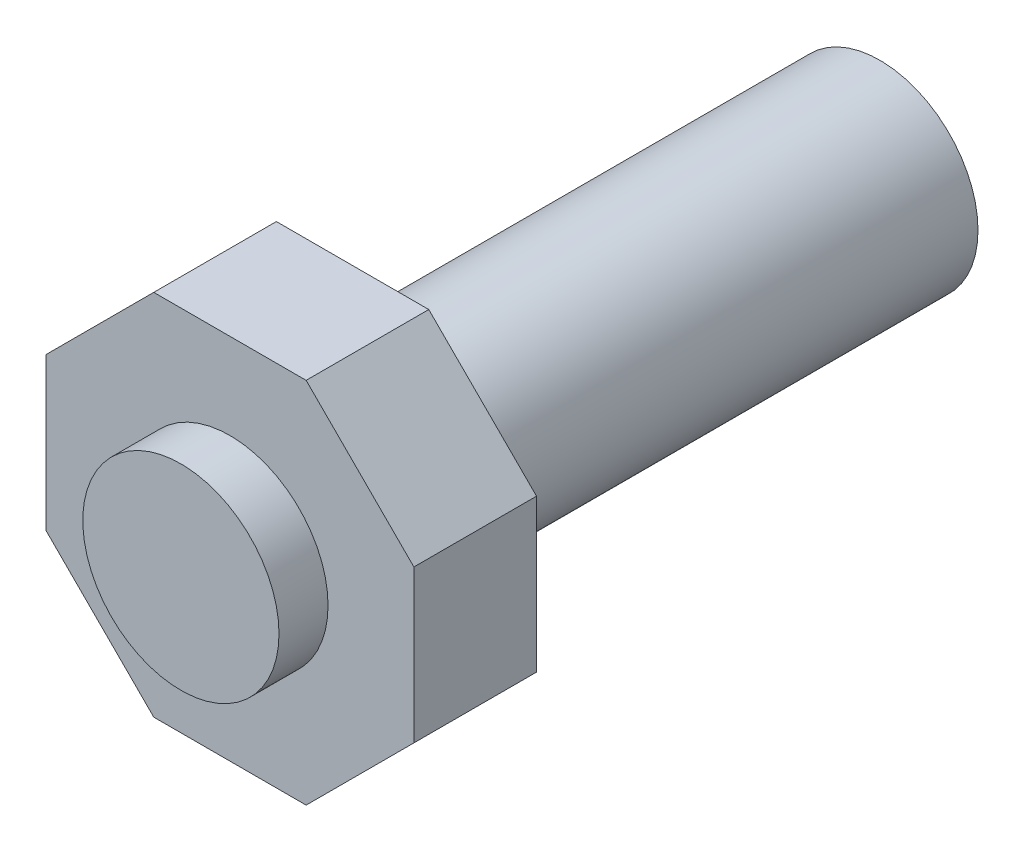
ISO-10303-21;
HEADER;
FILE_DESCRIPTION(('STEP AP214'),'2;1');
FILE_NAME('part.step','',(''),(''),'','','');
FILE_SCHEMA(('AUTOMOTIVE_DESIGN { 1 0 10303 214 1 1 1 1 }'));
ENDSEC;
DATA;
#1=APPLICATION_CONTEXT('core data for automotive mechanical design processes');
#2=APPLICATION_PROTOCOL_DEFINITION('international standard','automotive_design',2000,#1);
#3=PRODUCT_CONTEXT('',#1,'mechanical');
#4=PRODUCT('Part','Part','',(#3));
#5=PRODUCT_RELATED_PRODUCT_CATEGORY('part','',(#4));
#6=PRODUCT_DEFINITION_FORMATION('','',#4);
#7=PRODUCT_DEFINITION_CONTEXT('part definition',#1,'design');
#8=PRODUCT_DEFINITION('design','',#6,#7);
#9=PRODUCT_DEFINITION_SHAPE('','',#8);
#10=(LENGTH_UNIT() NAMED_UNIT(*) SI_UNIT(.MILLI.,.METRE.));
#11=(NAMED_UNIT(*) PLANE_ANGLE_UNIT() SI_UNIT($,.RADIAN.));
#12=(NAMED_UNIT(*) SI_UNIT($,.STERADIAN.) SOLID_ANGLE_UNIT());
#13=UNCERTAINTY_MEASURE_WITH_UNIT(LENGTH_MEASURE(1.E-05),#10,'distance_accuracy_value','');
#14=(GEOMETRIC_REPRESENTATION_CONTEXT(3) GLOBAL_UNCERTAINTY_ASSIGNED_CONTEXT((#13)) GLOBAL_UNIT_ASSIGNED_CONTEXT((#10,
#11,#12)) REPRESENTATION_CONTEXT('',''));
#15=CARTESIAN_POINT('',(0.,0.,0.));
#16=DIRECTION('',(0.,0.,1.));
#17=DIRECTION('',(1.,0.,0.));
#18=AXIS2_PLACEMENT_3D('',#15,#16,#17);
#19=CARTESIAN_POINT('',(8.,0.,43.));
#20=DIRECTION('',(0.,0.,1.));
#21=DIRECTION('',(1.,0.,0.));
#22=AXIS2_PLACEMENT_3D('',#19,#20,#21);
#23=PLANE('',#22);
#24=CARTESIAN_POINT('',(0.,0.,43.));
#25=DIRECTION('',(0.,0.,1.));
#26=DIRECTION('',(1.,0.,0.));
#27=AXIS2_PLACEMENT_3D('',#24,#25,#26);
#28=CIRCLE('',#27,8.);
#29=CARTESIAN_POINT('',(8.,0.,43.));
#30=VERTEX_POINT('',#29);
#31=EDGE_CURVE('E22',#30,#30,#28,.T.);
#32=ORIENTED_EDGE('',*,*,#31,.T.);
#33=EDGE_LOOP('',(#32));
#34=FACE_BOUND('',#33,.T.);
#35=DIRECTION('',(-0.707106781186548,-0.707106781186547,0.));
#36=VECTOR('',#35,1.);
#37=CARTESIAN_POINT('',(15.,-6.21320343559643,43.));
#38=LINE('',#37,#36);
#39=CARTESIAN_POINT('',(15.,-6.21320343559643,43.));
#40=VERTEX_POINT('',#39);
#41=CARTESIAN_POINT('',(6.21320343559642,-15.,43.));
#42=VERTEX_POINT('',#41);
#43=EDGE_CURVE('E91',#40,#42,#38,.T.);
#44=ORIENTED_EDGE('',*,*,#43,.T.);
#45=DIRECTION('',(1.,0.,0.));
#46=VECTOR('',#45,1.);
#47=CARTESIAN_POINT('',(-6.21320343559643,-15.,43.));
#48=LINE('',#47,#46);
#49=CARTESIAN_POINT('',(-6.21320343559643,-15.,43.));
#50=VERTEX_POINT('',#49);
#51=EDGE_CURVE('E97',#50,#42,#48,.T.);
#52=ORIENTED_EDGE('',*,*,#51,.F.);
#53=DIRECTION('',(0.707106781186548,-0.707106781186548,0.));
#54=VECTOR('',#53,1.);
#55=CARTESIAN_POINT('',(-15.,-6.21320343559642,43.));
#56=LINE('',#55,#54);
#57=CARTESIAN_POINT('',(-15.,-6.21320343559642,43.));
#58=VERTEX_POINT('',#57);
#59=EDGE_CURVE('E29',#58,#50,#56,.T.);
#60=ORIENTED_EDGE('',*,*,#59,.F.);
#61=DIRECTION('',(0.,-1.,0.));
#62=VECTOR('',#61,1.);
#63=CARTESIAN_POINT('',(-15.,6.21320343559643,43.));
#64=LINE('',#63,#62);
#65=CARTESIAN_POINT('',(-15.,6.21320343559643,43.));
#66=VERTEX_POINT('',#65);
#67=EDGE_CURVE('E111',#66,#58,#64,.T.);
#68=ORIENTED_EDGE('',*,*,#67,.F.);
#69=DIRECTION('',(0.707106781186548,0.707106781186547,0.));
#70=VECTOR('',#69,1.);
#71=CARTESIAN_POINT('',(-15.,6.21320343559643,43.));
#72=LINE('',#71,#70);
#73=CARTESIAN_POINT('',(-6.21320343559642,15.,43.));
#74=VERTEX_POINT('',#73);
#75=EDGE_CURVE('E108',#66,#74,#72,.T.);
#76=ORIENTED_EDGE('',*,*,#75,.T.);
#77=DIRECTION('',(1.,0.,0.));
#78=VECTOR('',#77,1.);
#79=CARTESIAN_POINT('',(-6.21320343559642,15.,43.));
#80=LINE('',#79,#78);
#81=CARTESIAN_POINT('',(6.21320343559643,15.,43.));
#82=VERTEX_POINT('',#81);
#83=EDGE_CURVE('E103',#74,#82,#80,.T.);
#84=ORIENTED_EDGE('',*,*,#83,.T.);
#85=DIRECTION('',(0.707106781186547,-0.707106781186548,0.));
#86=VECTOR('',#85,1.);
#87=CARTESIAN_POINT('',(6.21320343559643,15.,43.));
#88=LINE('',#87,#86);
#89=CARTESIAN_POINT('',(15.,6.21320343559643,43.));
#90=VERTEX_POINT('',#89);
#91=EDGE_CURVE('E101',#82,#90,#88,.T.);
#92=ORIENTED_EDGE('',*,*,#91,.T.);
#93=DIRECTION('',(0.,-1.,0.));
#94=VECTOR('',#93,1.);
#95=CARTESIAN_POINT('',(15.,6.21320343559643,43.));
#96=LINE('',#95,#94);
#97=EDGE_CURVE('E83',#90,#40,#96,.T.);
#98=ORIENTED_EDGE('',*,*,#97,.T.);
#99=EDGE_LOOP('',(#44,#52,#60,#68,#76,#84,#92,#98));
#100=FACE_BOUND('',#99,.T.);
#101=ADVANCED_FACE('F14',(#34,#100),#23,.F.);
#102=CARTESIAN_POINT('',(0.,0.,0.));
#103=DIRECTION('',(0.,0.,1.));
#104=DIRECTION('',(1.,0.,0.));
#105=AXIS2_PLACEMENT_3D('',#102,#103,#104);
#106=PLANE('',#105);
#107=CARTESIAN_POINT('',(0.,0.,0.));
#108=DIRECTION('',(0.,0.,1.));
#109=DIRECTION('',(1.,0.,0.));
#110=AXIS2_PLACEMENT_3D('',#107,#108,#109);
#111=CIRCLE('',#110,8.);
#112=CARTESIAN_POINT('',(8.,0.,0.));
#113=VERTEX_POINT('',#112);
#114=EDGE_CURVE('E9',#113,#113,#111,.T.);
#115=ORIENTED_EDGE('',*,*,#114,.F.);
#116=EDGE_LOOP('',(#115));
#117=FACE_BOUND('',#116,.T.);
#118=ADVANCED_FACE('F16',(#117),#106,.F.);
#119=CARTESIAN_POINT('',(0.,0.,80.));
#120=DIRECTION('',(0.,0.,1.));
#121=DIRECTION('',(1.,0.,0.));
#122=AXIS2_PLACEMENT_3D('',#119,#120,#121);
#123=CYLINDRICAL_SURFACE('',#122,8.);
#124=ORIENTED_EDGE('',*,*,#31,.F.);
#125=EDGE_LOOP('',(#124));
#126=FACE_BOUND('',#125,.T.);
#127=ORIENTED_EDGE('',*,*,#114,.T.);
#128=EDGE_LOOP('',(#127));
#129=FACE_BOUND('',#128,.T.);
#130=ADVANCED_FACE('F155',(#126,#129),#123,.T.);
#131=CARTESIAN_POINT('',(15.,-6.21320343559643,53.));
#132=DIRECTION('',(0.707106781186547,-0.707106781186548,0.));
#133=DIRECTION('',(0.707106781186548,0.707106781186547,0.));
#134=AXIS2_PLACEMENT_3D('',#131,#132,#133);
#135=PLANE('',#134);
#136=DIRECTION('',(0.,0.,-1.));
#137=VECTOR('',#136,1.);
#138=CARTESIAN_POINT('',(15.,-6.21320343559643,53.));
#139=LINE('',#138,#137);
#140=CARTESIAN_POINT('',(15.,-6.21320343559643,53.));
#141=VERTEX_POINT('',#140);
#142=EDGE_CURVE('E79',#141,#40,#139,.T.);
#143=ORIENTED_EDGE('',*,*,#142,.F.);
#144=DIRECTION('',(-0.707106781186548,-0.707106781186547,0.));
#145=VECTOR('',#144,1.);
#146=CARTESIAN_POINT('',(15.,-6.21320343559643,53.));
#147=LINE('',#146,#145);
#148=CARTESIAN_POINT('',(6.21320343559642,-15.,53.));
#149=VERTEX_POINT('',#148);
#150=EDGE_CURVE('E37',#141,#149,#147,.T.);
#151=ORIENTED_EDGE('',*,*,#150,.T.);
#152=DIRECTION('',(0.,0.,-1.));
#153=VECTOR('',#152,1.);
#154=CARTESIAN_POINT('',(6.21320343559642,-15.,53.));
#155=LINE('',#154,#153);
#156=EDGE_CURVE('E93',#149,#42,#155,.T.);
#157=ORIENTED_EDGE('',*,*,#156,.T.);
#158=ORIENTED_EDGE('',*,*,#43,.F.);
#159=EDGE_LOOP('',(#143,#151,#157,#158));
#160=FACE_BOUND('',#159,.T.);
#161=ADVANCED_FACE('F92',(#160),#135,.T.);
#162=CARTESIAN_POINT('',(15.,6.21320343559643,53.));
#163=DIRECTION('',(1.,0.,0.));
#164=DIRECTION('',(0.,0.,-1.));
#165=AXIS2_PLACEMENT_3D('',#162,#163,#164);
#166=PLANE('',#165);
#167=DIRECTION('',(0.,0.,-1.));
#168=VECTOR('',#167,1.);
#169=CARTESIAN_POINT('',(15.,6.21320343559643,53.));
#170=LINE('',#169,#168);
#171=CARTESIAN_POINT('',(15.,6.21320343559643,53.));
#172=VERTEX_POINT('',#171);
#173=EDGE_CURVE('E88',#172,#90,#170,.T.);
#174=ORIENTED_EDGE('',*,*,#173,.F.);
#175=DIRECTION('',(0.,-1.,0.));
#176=VECTOR('',#175,1.);
#177=CARTESIAN_POINT('',(15.,6.21320343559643,53.));
#178=LINE('',#177,#176);
#179=EDGE_CURVE('E86',#172,#141,#178,.T.);
#180=ORIENTED_EDGE('',*,*,#179,.T.);
#181=ORIENTED_EDGE('',*,*,#142,.T.);
#182=ORIENTED_EDGE('',*,*,#97,.F.);
#183=EDGE_LOOP('',(#174,#180,#181,#182));
#184=FACE_BOUND('',#183,.T.);
#185=ADVANCED_FACE('F81',(#184),#166,.T.);
#186=CARTESIAN_POINT('',(6.21320343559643,15.,53.));
#187=DIRECTION('',(0.707106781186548,0.707106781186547,0.));
#188=DIRECTION('',(-0.707106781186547,0.707106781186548,0.));
#189=AXIS2_PLACEMENT_3D('',#186,#187,#188);
#190=PLANE('',#189);
#191=DIRECTION('',(0.,0.,-1.));
#192=VECTOR('',#191,1.);
#193=CARTESIAN_POINT('',(6.21320343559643,15.,53.));
#194=LINE('',#193,#192);
#195=CARTESIAN_POINT('',(6.21320343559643,15.,53.));
#196=VERTEX_POINT('',#195);
#197=EDGE_CURVE('E144',#196,#82,#194,.T.);
#198=ORIENTED_EDGE('',*,*,#197,.F.);
#199=DIRECTION('',(0.707106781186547,-0.707106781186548,0.));
#200=VECTOR('',#199,1.);
#201=CARTESIAN_POINT('',(6.21320343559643,15.,53.));
#202=LINE('',#201,#200);
#203=EDGE_CURVE('E124',#196,#172,#202,.T.);
#204=ORIENTED_EDGE('',*,*,#203,.T.);
#205=ORIENTED_EDGE('',*,*,#173,.T.);
#206=ORIENTED_EDGE('',*,*,#91,.F.);
#207=EDGE_LOOP('',(#198,#204,#205,#206));
#208=FACE_BOUND('',#207,.T.);
#209=ADVANCED_FACE('F186',(#208),#190,.T.);
#210=CARTESIAN_POINT('',(-6.21320343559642,15.,53.));
#211=DIRECTION('',(0.,1.,0.));
#212=DIRECTION('',(-1.,0.,0.));
#213=AXIS2_PLACEMENT_3D('',#210,#211,#212);
#214=PLANE('',#213);
#215=DIRECTION('',(0.,0.,-1.));
#216=VECTOR('',#215,1.);
#217=CARTESIAN_POINT('',(-6.21320343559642,15.,53.));
#218=LINE('',#217,#216);
#219=CARTESIAN_POINT('',(-6.21320343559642,15.,53.));
#220=VERTEX_POINT('',#219);
#221=EDGE_CURVE('E142',#220,#74,#218,.T.);
#222=ORIENTED_EDGE('',*,*,#221,.F.);
#223=DIRECTION('',(1.,0.,0.));
#224=VECTOR('',#223,1.);
#225=CARTESIAN_POINT('',(-6.21320343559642,15.,53.));
#226=LINE('',#225,#224);
#227=EDGE_CURVE('E128',#220,#196,#226,.T.);
#228=ORIENTED_EDGE('',*,*,#227,.T.);
#229=ORIENTED_EDGE('',*,*,#197,.T.);
#230=ORIENTED_EDGE('',*,*,#83,.F.);
#231=EDGE_LOOP('',(#222,#228,#229,#230));
#232=FACE_BOUND('',#231,.T.);
#233=ADVANCED_FACE('F189',(#232),#214,.T.);
#234=CARTESIAN_POINT('',(-15.,6.21320343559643,53.));
#235=DIRECTION('',(-0.707106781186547,0.707106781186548,0.));
#236=DIRECTION('',(-0.707106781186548,-0.707106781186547,0.));
#237=AXIS2_PLACEMENT_3D('',#234,#235,#236);
#238=PLANE('',#237);
#239=DIRECTION('',(0.,0.,-1.));
#240=VECTOR('',#239,1.);
#241=CARTESIAN_POINT('',(-15.,6.21320343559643,53.));
#242=LINE('',#241,#240);
#243=CARTESIAN_POINT('',(-15.,6.21320343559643,53.));
#244=VERTEX_POINT('',#243);
#245=EDGE_CURVE('E140',#244,#66,#242,.T.);
#246=ORIENTED_EDGE('',*,*,#245,.F.);
#247=DIRECTION('',(0.707106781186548,0.707106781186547,0.));
#248=VECTOR('',#247,1.);
#249=CARTESIAN_POINT('',(-15.,6.21320343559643,53.));
#250=LINE('',#249,#248);
#251=EDGE_CURVE('E125',#244,#220,#250,.T.);
#252=ORIENTED_EDGE('',*,*,#251,.T.);
#253=ORIENTED_EDGE('',*,*,#221,.T.);
#254=ORIENTED_EDGE('',*,*,#75,.F.);
#255=EDGE_LOOP('',(#246,#252,#253,#254));
#256=FACE_BOUND('',#255,.T.);
#257=ADVANCED_FACE('F193',(#256),#238,.T.);
#258=CARTESIAN_POINT('',(-15.,6.21320343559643,53.));
#259=DIRECTION('',(1.,0.,0.));
#260=DIRECTION('',(0.,1.,0.));
#261=AXIS2_PLACEMENT_3D('',#258,#259,#260);
#262=PLANE('',#261);
#263=DIRECTION('',(0.,0.,-1.));
#264=VECTOR('',#263,1.);
#265=CARTESIAN_POINT('',(-15.,-6.21320343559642,53.));
#266=LINE('',#265,#264);
#267=CARTESIAN_POINT('',(-15.,-6.21320343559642,53.));
#268=VERTEX_POINT('',#267);
#269=EDGE_CURVE('E138',#268,#58,#266,.T.);
#270=ORIENTED_EDGE('',*,*,#269,.F.);
#271=DIRECTION('',(0.,-1.,0.));
#272=VECTOR('',#271,1.);
#273=CARTESIAN_POINT('',(-15.,6.21320343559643,53.));
#274=LINE('',#273,#272);
#275=EDGE_CURVE('E122',#244,#268,#274,.T.);
#276=ORIENTED_EDGE('',*,*,#275,.F.);
#277=ORIENTED_EDGE('',*,*,#245,.T.);
#278=ORIENTED_EDGE('',*,*,#67,.T.);
#279=EDGE_LOOP('',(#270,#276,#277,#278));
#280=FACE_BOUND('',#279,.T.);
#281=ADVANCED_FACE('F197',(#280),#262,.F.);
#282=CARTESIAN_POINT('',(-15.,-6.21320343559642,53.));
#283=DIRECTION('',(0.707106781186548,0.707106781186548,0.));
#284=DIRECTION('',(-0.707106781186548,0.707106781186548,0.));
#285=AXIS2_PLACEMENT_3D('',#282,#283,#284);
#286=PLANE('',#285);
#287=DIRECTION('',(0.,0.,-1.));
#288=VECTOR('',#287,1.);
#289=CARTESIAN_POINT('',(-6.21320343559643,-15.,53.));
#290=LINE('',#289,#288);
#291=CARTESIAN_POINT('',(-6.21320343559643,-15.,53.));
#292=VERTEX_POINT('',#291);
#293=EDGE_CURVE('E136',#292,#50,#290,.T.);
#294=ORIENTED_EDGE('',*,*,#293,.F.);
#295=DIRECTION('',(0.707106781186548,-0.707106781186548,0.));
#296=VECTOR('',#295,1.);
#297=CARTESIAN_POINT('',(-15.,-6.21320343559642,53.));
#298=LINE('',#297,#296);
#299=EDGE_CURVE('E119',#268,#292,#298,.T.);
#300=ORIENTED_EDGE('',*,*,#299,.F.);
#301=ORIENTED_EDGE('',*,*,#269,.T.);
#302=ORIENTED_EDGE('',*,*,#59,.T.);
#303=EDGE_LOOP('',(#294,#300,#301,#302));
#304=FACE_BOUND('',#303,.T.);
#305=ADVANCED_FACE('F201',(#304),#286,.F.);
#306=CARTESIAN_POINT('',(-6.21320343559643,-15.,53.));
#307=DIRECTION('',(0.,1.,0.));
#308=DIRECTION('',(0.,0.,1.));
#309=AXIS2_PLACEMENT_3D('',#306,#307,#308);
#310=PLANE('',#309);
#311=DIRECTION('',(1.,0.,0.));
#312=VECTOR('',#311,1.);
#313=CARTESIAN_POINT('',(-6.21320343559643,-15.,53.));
#314=LINE('',#313,#312);
#315=EDGE_CURVE('E116',#292,#149,#314,.T.);
#316=ORIENTED_EDGE('',*,*,#315,.F.);
#317=ORIENTED_EDGE('',*,*,#293,.T.);
#318=ORIENTED_EDGE('',*,*,#51,.T.);
#319=ORIENTED_EDGE('',*,*,#156,.F.);
#320=EDGE_LOOP('',(#316,#317,#318,#319));
#321=FACE_BOUND('',#320,.T.);
#322=ADVANCED_FACE('F182',(#321),#310,.F.);
#323=CARTESIAN_POINT('',(8.,0.,57.));
#324=DIRECTION('',(0.,0.,-1.));
#325=DIRECTION('',(-1.,0.,0.));
#326=AXIS2_PLACEMENT_3D('',#323,#324,#325);
#327=PLANE('',#326);
#328=CARTESIAN_POINT('',(0.,0.,57.));
#329=DIRECTION('',(0.,0.,1.));
#330=DIRECTION('',(1.,0.,0.));
#331=AXIS2_PLACEMENT_3D('',#328,#329,#330);
#332=CIRCLE('',#331,8.);
#333=CARTESIAN_POINT('',(8.,0.,57.));
#334=VERTEX_POINT('',#333);
#335=EDGE_CURVE('E87',#334,#334,#332,.T.);
#336=ORIENTED_EDGE('',*,*,#335,.T.);
#337=EDGE_LOOP('',(#336));
#338=FACE_BOUND('',#337,.T.);
#339=ADVANCED_FACE('F178',(#338),#327,.F.);
#340=CARTESIAN_POINT('',(0.,0.,80.));
#341=DIRECTION('',(0.,0.,1.));
#342=DIRECTION('',(1.,0.,0.));
#343=AXIS2_PLACEMENT_3D('',#340,#341,#342);
#344=CYLINDRICAL_SURFACE('',#343,8.);
#345=ORIENTED_EDGE('',*,*,#335,.F.);
#346=EDGE_LOOP('',(#345));
#347=FACE_BOUND('',#346,.T.);
#348=CARTESIAN_POINT('',(0.,0.,53.));
#349=DIRECTION('',(0.,0.,1.));
#350=DIRECTION('',(1.,0.,0.));
#351=AXIS2_PLACEMENT_3D('',#348,#349,#350);
#352=CIRCLE('',#351,8.);
#353=CARTESIAN_POINT('',(8.,0.,53.));
#354=VERTEX_POINT('',#353);
#355=EDGE_CURVE('E149',#354,#354,#352,.T.);
#356=ORIENTED_EDGE('',*,*,#355,.T.);
#357=EDGE_LOOP('',(#356));
#358=FACE_BOUND('',#357,.T.);
#359=ADVANCED_FACE('F174',(#347,#358),#344,.T.);
#360=CARTESIAN_POINT('',(17.,0.,53.));
#361=DIRECTION('',(0.,0.,-1.));
#362=DIRECTION('',(-1.,0.,0.));
#363=AXIS2_PLACEMENT_3D('',#360,#361,#362);
#364=PLANE('',#363);
#365=ORIENTED_EDGE('',*,*,#355,.F.);
#366=EDGE_LOOP('',(#365));
#367=FACE_BOUND('',#366,.T.);
#368=ORIENTED_EDGE('',*,*,#150,.F.);
#369=ORIENTED_EDGE('',*,*,#179,.F.);
#370=ORIENTED_EDGE('',*,*,#203,.F.);
#371=ORIENTED_EDGE('',*,*,#227,.F.);
#372=ORIENTED_EDGE('',*,*,#251,.F.);
#373=ORIENTED_EDGE('',*,*,#275,.T.);
#374=ORIENTED_EDGE('',*,*,#299,.T.);
#375=ORIENTED_EDGE('',*,*,#315,.T.);
#376=EDGE_LOOP('',(#368,#369,#370,#371,#372,#373,#374,#375));
#377=FACE_BOUND('',#376,.T.);
#378=ADVANCED_FACE('F171',(#367,#377),#364,.F.);
#379=CLOSED_SHELL('',(#101,#118,#130,#161,#185,#209,#233,#257,#281,#305,#322,#339,#359,#378));
#380=MANIFOLD_SOLID_BREP('B1',#379);
#381=ADVANCED_BREP_SHAPE_REPRESENTATION('',(#18,#380),#14);
#382=SHAPE_DEFINITION_REPRESENTATION(#9,#381);
ENDSEC;
END-ISO-10303-21;
